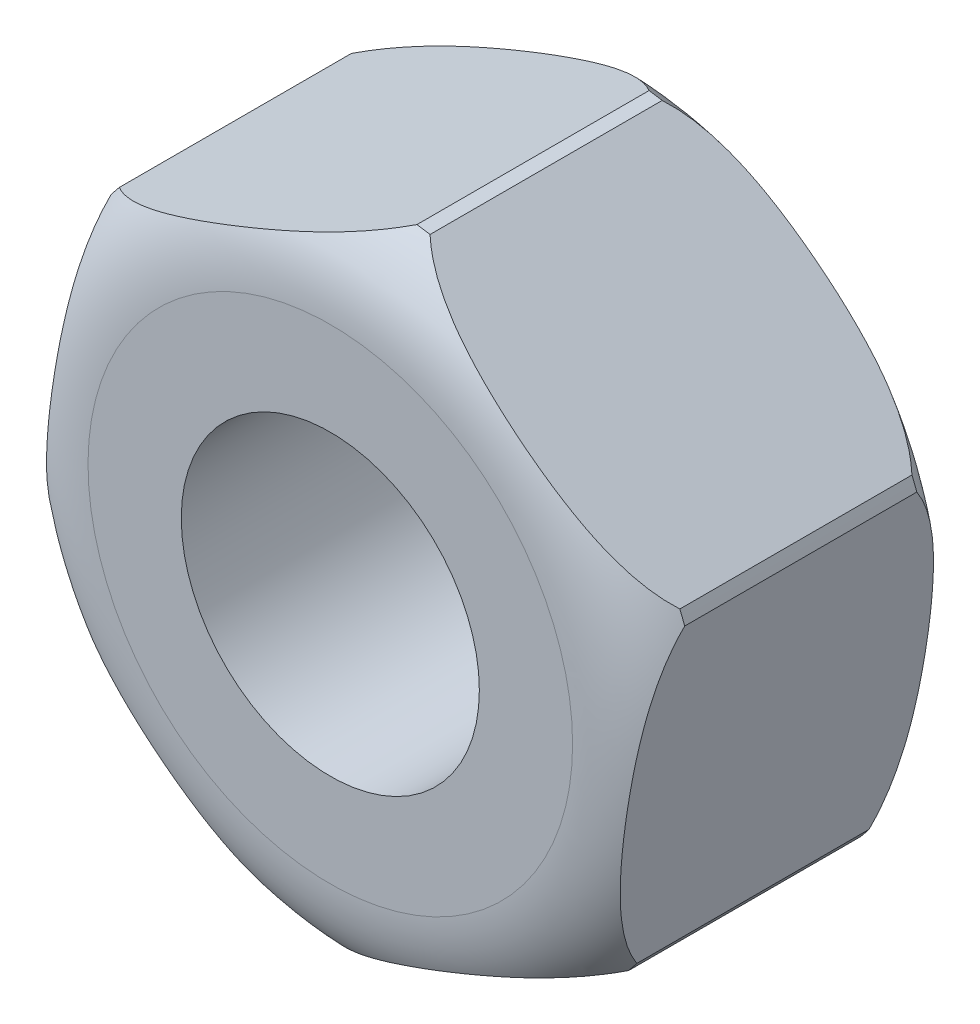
from build123d import *

# Parameters (mm, degrees)
BOSS_EXTRU_1_DEPTH      = 3
ESQUISSE4_R             = 1.4
ENL_V_MAT_EXTRU_2_DEPTH = 6.221333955


with BuildPart() as part:
    # Esquisse1 → Boss.-Extru.1 (new body)
    with BuildSketch(Plane.XY):
        Polygon((-2.458996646, 1.963203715), (-2.929682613, -1.147951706), (-0.470685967, -3.111155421), (2.458996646, -1.963203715), (2.929682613, 1.147951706), (0.470685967, 3.111155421), align=None)
    extrude(amount=BOSS_EXTRU_1_DEPTH)

    # Esquisse4 → Enl_v. mat.-Extru.2 (cut, through all)
    with BuildSketch(Plane.XY.offset(3)):
        Circle(ESQUISSE4_R)
    extrude(amount=-ENL_V_MAT_EXTRU_2_DEPTH, mode=Mode.SUBTRACT)

    # Esquisse5 → Enl_vement de mati_re-R_volution1 (revolve, cut)
    with BuildSketch(Plane(origin=(0, 0, 0), x_dir=(0, 0, -1), z_dir=(1, 0, 0))):
        with BuildLine():
            Line((-2.590147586, 3.111155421), (-0.409852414, 3.111155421))
            add(Edge.make_bspline(
                [(-0.409852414, 3.111155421), (-0.014985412, 2.842738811), (0, 2.275782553)],
                knots=[0, 0, 0, 1, 1, 1], degree=2))
            Line((0, 2.275782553), (0.95108112, 2.275782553))
            Line((0.95108112, 2.275782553), (0.95108112, 4.07035848))
            Line((0.95108112, 4.07035848), (-3.613760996, 4.07035848))
            Line((-3.613760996, 4.07035848), (-3.613760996, 2.275782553))
            Line((-3.613760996, 2.275782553), (-3, 2.275782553))
            add(Edge.make_bspline(
                [(-2.590147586, 3.111155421), (-2.985014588, 2.842738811), (-3, 2.275782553)],
                knots=[0, 0, 0, 1, 1, 1], degree=2))
        make_face()
    revolve(axis=Axis((0, 0, 3), (0, 0, -1)), mode=Mode.SUBTRACT)


solid = part.part
